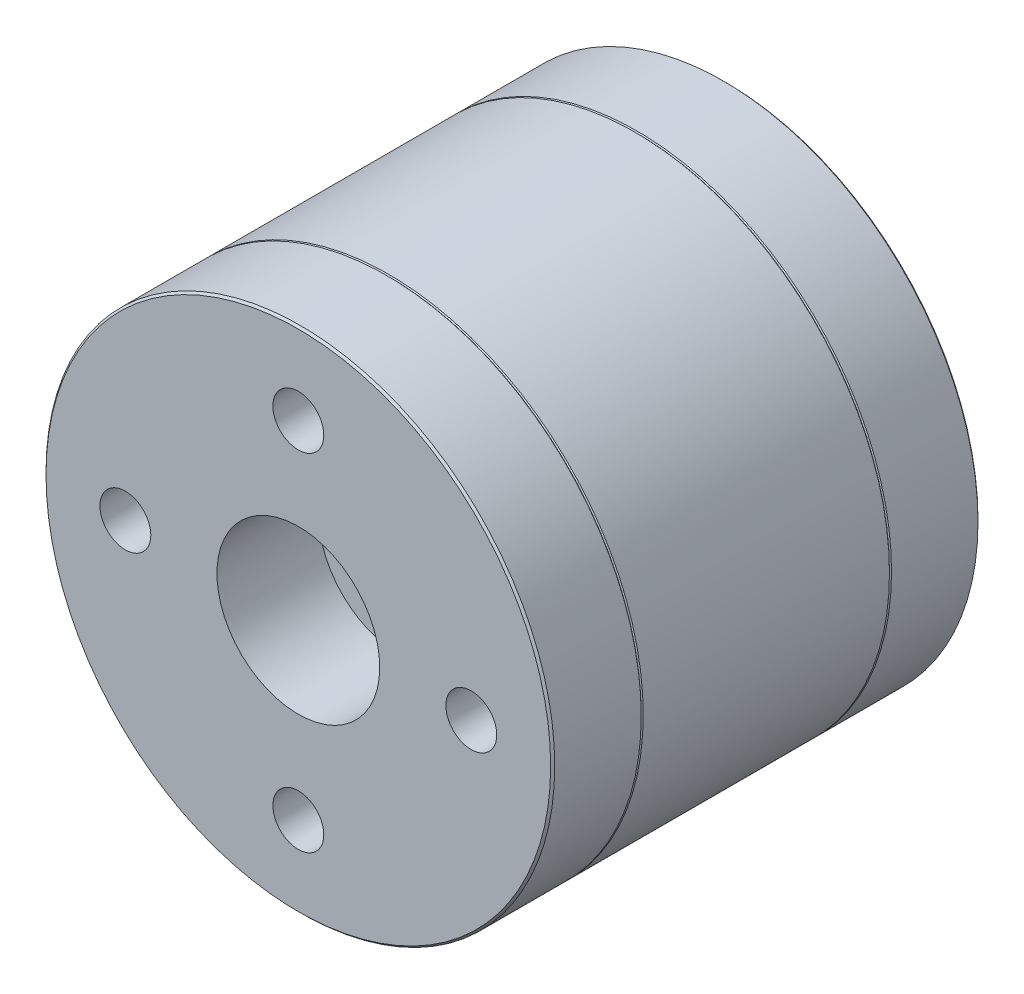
from build123d import *

# Parameters (mm, degrees)
SKETCH1_R           = 12.5
BOSS_EXTRUDE1_DEPTH = 10.5
CHAMFER1_SIZE       = 0.1
SKETCH4_R           = 3.51
CUT_EXTRUDE1_DEPTH  = 1
SKETCH5_R           = 3.5
BOSS_EXTRUDE2_DEPTH = 3.5
CUT_EXTRUDE2_REACH  = 31.407
SKETCH6_R           = 2
SKETCH7_R           = 4
CUT_EXTRUDE3_DEPTH  = 5
CHAMFER2_SIZE       = 0.2
CUT_EXTRUDE4_REACH  = 29.45
SKETCH8_R           = 1.25
SKETCH9_R           = 2.5
CUT_EXTRUDE5_DEPTH  = 3
CHAMFER3_SIZE       = 0.25


with BuildPart() as part:
    # Sketch1 → Boss-Extrude1 (new, symmetric)
    with BuildSketch(Plane.XY):
        with Locations(Location((0, 0, 0), (0, 0, 180))):
            Circle(SKETCH1_R)
    extrude(amount=BOSS_EXTRUDE1_DEPTH, both=True)

    # Sketch2 → Cut-Revolve1 (revolve, cut)
    with BuildSketch(Plane(origin=(0, 0, 0), x_dir=(0, 0, -1), z_dir=(1, 0, 0)), mode=Mode.PRIVATE) as cut_revolve1_sk:
        Polygon((-6.15, 12.5), (-6.05, 12.5), (-6.1, 12.45), align=None)
        Polygon((6.05, 12.5), (6.15, 12.5), (6.1, 12.45), align=None)
    revolve(cut_revolve1_sk.sketch.rotate(Axis((0, 0, 10.5), (0, 0, -1)), 270), axis=Axis((0, 0, 10.5), (0, 0, -1)), mode=Mode.SUBTRACT)

    # Chamfer1
    chamfer1_edges = [part.edges().sort_by_distance(p)[0] for p in [
        (12.5, 0, -10.5),
        (12.5, 0, 10.5),
    ]]
    chamfer(chamfer1_edges, length=CHAMFER1_SIZE)

    # Sketch4 → Cut-Extrude1 (cut)
    with BuildSketch(Plane(origin=(0, 0, -10.5), x_dir=(-1, 0, 0), z_dir=(0, 0, -1))):
        Circle(SKETCH4_R)
    extrude(amount=-CUT_EXTRUDE1_DEPTH, mode=Mode.SUBTRACT)

    # Sketch5 → Boss-Extrude2 (add)
    with BuildSketch(Plane(origin=(0, 0, -9.5), x_dir=(-1, 0, 0), z_dir=(0, 0, -1))):
        Circle(SKETCH5_R)
    extrude(amount=BOSS_EXTRUDE2_DEPTH)

    # Sketch6 → Cut-Extrude2 (cut, up to next)
    with BuildSketch(Plane(origin=(0, 0, -13), x_dir=(-1, 0, 0), z_dir=(0, 0, -1)), mode=Mode.PRIVATE) as cut_extrude2_sk1:
        Circle(SKETCH6_R)
    cut_extrude2_tool1 = extrude(cut_extrude2_sk1.sketch, amount=-CUT_EXTRUDE2_REACH, mode=Mode.PRIVATE) & part.part
    add(cut_extrude2_tool1.solids().sort_by_distance((0, 0, -13))[0], mode=Mode.SUBTRACT)

    # Sketch7 → Cut-Extrude3 (cut)
    with BuildSketch(Plane.XY.offset(10.5)):
        Circle(SKETCH7_R)
    extrude(amount=-CUT_EXTRUDE3_DEPTH, mode=Mode.SUBTRACT)

    # Chamfer2
    chamfer2_edges = [part.edges().sort_by_distance(p)[0] for p in [
        (3.5, 0, -13),
        (2, 0, -13),
    ]]
    chamfer(chamfer2_edges, length=CHAMFER2_SIZE)

    # Sketch8 → Cut-Extrude4 (cut, up to next)
    with BuildSketch(Plane(origin=(0, 0, -10.5), x_dir=(-1, 0, 0), z_dir=(0, 0, -1)), mode=Mode.PRIVATE) as cut_extrude4_sk1:
        with Locations((0, 8.5)):
            Circle(SKETCH8_R)
    cut_extrude4_tool1 = extrude(cut_extrude4_sk1.sketch, amount=-CUT_EXTRUDE4_REACH, mode=Mode.PRIVATE) & part.part
    # Sketch8 → Cut-Extrude4 (cut, up to next)
    with BuildSketch(Plane(origin=(0, 0, -10.5), x_dir=(-1, 0, 0), z_dir=(0, 0, -1)), mode=Mode.PRIVATE) as cut_extrude4_sk2:
        with Locations((8.5, 0)):
            Circle(SKETCH8_R)
    cut_extrude4_tool2 = extrude(cut_extrude4_sk2.sketch, amount=-CUT_EXTRUDE4_REACH, mode=Mode.PRIVATE) & part.part
    # Sketch8 → Cut-Extrude4 (cut, up to next)
    with BuildSketch(Plane(origin=(0, 0, -10.5), x_dir=(-1, 0, 0), z_dir=(0, 0, -1)), mode=Mode.PRIVATE) as cut_extrude4_sk3:
        with Locations((0, -8.5)):
            Circle(SKETCH8_R)
    cut_extrude4_tool3 = extrude(cut_extrude4_sk3.sketch, amount=-CUT_EXTRUDE4_REACH, mode=Mode.PRIVATE) & part.part
    # Sketch8 → Cut-Extrude4 (cut, up to next)
    with BuildSketch(Plane(origin=(0, 0, -10.5), x_dir=(-1, 0, 0), z_dir=(0, 0, -1)), mode=Mode.PRIVATE) as cut_extrude4_sk4:
        with Locations((-8.5, 0)):
            Circle(SKETCH8_R)
    cut_extrude4_tool4 = extrude(cut_extrude4_sk4.sketch, amount=-CUT_EXTRUDE4_REACH, mode=Mode.PRIVATE) & part.part
    add(cut_extrude4_tool1.solids().sort_by_distance((0, 8.5, -10.5))[0], mode=Mode.SUBTRACT)
    add(cut_extrude4_tool2.solids().sort_by_distance((-8.5, 0, -10.5))[0], mode=Mode.SUBTRACT)
    add(cut_extrude4_tool3.solids().sort_by_distance((0, -8.5, -10.5))[0], mode=Mode.SUBTRACT)
    add(cut_extrude4_tool4.solids().sort_by_distance((8.5, 0, -10.5))[0], mode=Mode.SUBTRACT)

    # Sketch9 → Cut-Extrude5 (cut)
    with BuildSketch(Plane(origin=(0, 0, -10.5), x_dir=(-1, 0, 0), z_dir=(0, 0, -1))):
        with Locations((-8.5, 0)):
            Circle(SKETCH9_R)
        with Locations((8.5, 0)):
            Circle(SKETCH9_R)
    extrude(amount=-CUT_EXTRUDE5_DEPTH, mode=Mode.SUBTRACT)

    # Chamfer3
    chamfer3_edges = [part.edges().sort_by_distance(p)[0] for p in [
        (11, 0, -10.5),
        (-6, 0, -10.5),
    ]]
    chamfer(chamfer3_edges, length=CHAMFER3_SIZE)


solid = part.part
